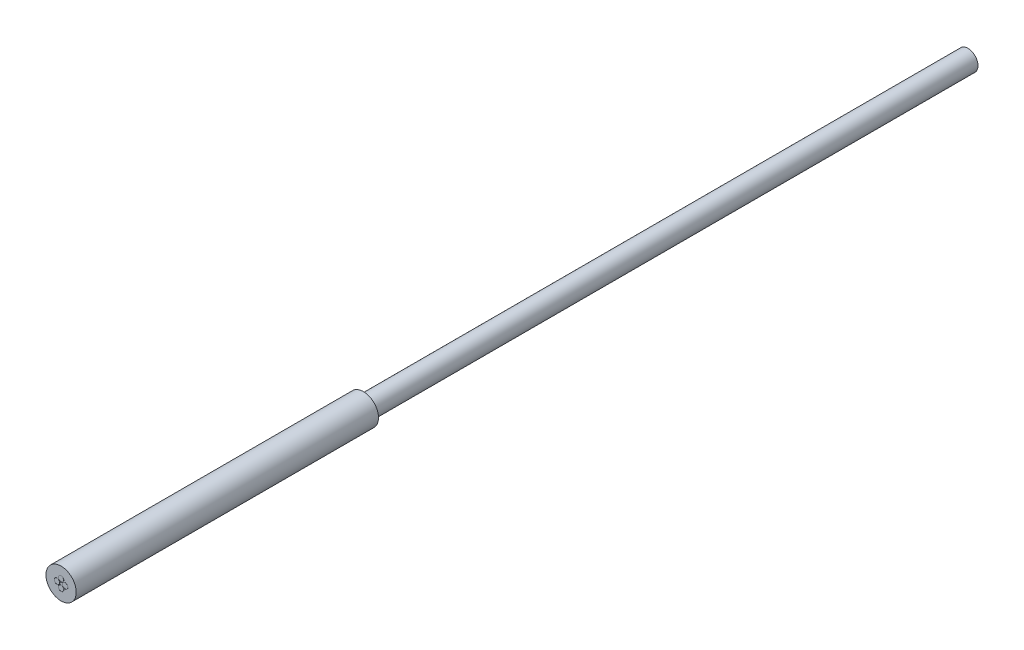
ISO-10303-21;
HEADER;
FILE_DESCRIPTION(('STEP AP214'),'2;1');
FILE_NAME('part.step','',(''),(''),'','','');
FILE_SCHEMA(('AUTOMOTIVE_DESIGN { 1 0 10303 214 1 1 1 1 }'));
ENDSEC;
DATA;
#1=APPLICATION_CONTEXT('core data for automotive mechanical design processes');
#2=APPLICATION_PROTOCOL_DEFINITION('international standard','automotive_design',2000,#1);
#3=PRODUCT_CONTEXT('',#1,'mechanical');
#4=PRODUCT('Part','Part','',(#3));
#5=PRODUCT_RELATED_PRODUCT_CATEGORY('part','',(#4));
#6=PRODUCT_DEFINITION_FORMATION('','',#4);
#7=PRODUCT_DEFINITION_CONTEXT('part definition',#1,'design');
#8=PRODUCT_DEFINITION('design','',#6,#7);
#9=PRODUCT_DEFINITION_SHAPE('','',#8);
#10=(LENGTH_UNIT() NAMED_UNIT(*) SI_UNIT(.MILLI.,.METRE.));
#11=(NAMED_UNIT(*) PLANE_ANGLE_UNIT() SI_UNIT($,.RADIAN.));
#12=(NAMED_UNIT(*) SI_UNIT($,.STERADIAN.) SOLID_ANGLE_UNIT());
#13=UNCERTAINTY_MEASURE_WITH_UNIT(LENGTH_MEASURE(1.E-05),#10,'distance_accuracy_value','');
#14=(GEOMETRIC_REPRESENTATION_CONTEXT(3) GLOBAL_UNCERTAINTY_ASSIGNED_CONTEXT((#13)) GLOBAL_UNIT_ASSIGNED_CONTEXT((#10,
#11,#12)) REPRESENTATION_CONTEXT('',''));
#15=CARTESIAN_POINT('',(0.,0.,0.));
#16=DIRECTION('',(0.,0.,1.));
#17=DIRECTION('',(1.,0.,0.));
#18=AXIS2_PLACEMENT_3D('',#15,#16,#17);
#19=CARTESIAN_POINT('',(0.,0.,-15.));
#20=DIRECTION('',(0.,0.,1.));
#21=DIRECTION('',(1.,0.,0.));
#22=AXIS2_PLACEMENT_3D('',#19,#20,#21);
#23=CYLINDRICAL_SURFACE('',#22,0.750000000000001);
#24=CARTESIAN_POINT('',(0.,0.,-15.));
#25=DIRECTION('',(0.,0.,1.));
#26=DIRECTION('',(1.,0.,0.));
#27=AXIS2_PLACEMENT_3D('',#24,#25,#26);
#28=CIRCLE('',#27,0.750000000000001);
#29=CARTESIAN_POINT('',(0.750000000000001,0.,-15.));
#30=VERTEX_POINT('',#29);
#31=EDGE_CURVE('E40',#30,#30,#28,.T.);
#32=ORIENTED_EDGE('',*,*,#31,.T.);
#33=EDGE_LOOP('',(#32));
#34=FACE_BOUND('',#33,.T.);
#35=CARTESIAN_POINT('',(0.,0.,0.));
#36=DIRECTION('',(0.,0.,1.));
#37=DIRECTION('',(1.,0.,0.));
#38=AXIS2_PLACEMENT_3D('',#35,#36,#37);
#39=CIRCLE('',#38,0.750000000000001);
#40=CARTESIAN_POINT('',(0.750000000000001,0.,0.));
#41=VERTEX_POINT('',#40);
#42=EDGE_CURVE('E36',#41,#41,#39,.T.);
#43=ORIENTED_EDGE('',*,*,#42,.F.);
#44=EDGE_LOOP('',(#43));
#45=FACE_BOUND('',#44,.T.);
#46=ADVANCED_FACE('F33',(#34,#45),#23,.T.);
#47=CARTESIAN_POINT('',(0.,0.,-15.));
#48=DIRECTION('',(0.,0.,1.));
#49=DIRECTION('',(1.,0.,0.));
#50=AXIS2_PLACEMENT_3D('',#47,#48,#49);
#51=PLANE('',#50);
#52=CARTESIAN_POINT('',(0.,0.,-15.));
#53=DIRECTION('',(0.,0.,-1.));
#54=DIRECTION('',(-1.,0.,0.));
#55=AXIS2_PLACEMENT_3D('',#52,#53,#54);
#56=CIRCLE('',#55,0.5);
#57=CARTESIAN_POINT('',(-0.5,0.,-15.));
#58=VERTEX_POINT('',#57);
#59=EDGE_CURVE('E10',#58,#58,#56,.T.);
#60=ORIENTED_EDGE('',*,*,#59,.F.);
#61=EDGE_LOOP('',(#60));
#62=FACE_BOUND('',#61,.T.);
#63=ORIENTED_EDGE('',*,*,#31,.F.);
#64=EDGE_LOOP('',(#63));
#65=FACE_BOUND('',#64,.T.);
#66=ADVANCED_FACE('F118',(#62,#65),#51,.F.);
#67=CARTESIAN_POINT('',(0.,0.,0.));
#68=DIRECTION('',(0.,0.,1.));
#69=DIRECTION('',(1.,0.,0.));
#70=AXIS2_PLACEMENT_3D('',#67,#68,#69);
#71=PLANE('',#70);
#72=CARTESIAN_POINT('',(0.,-0.201525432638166,0.));
#73=DIRECTION('',(0.,0.,1.));
#74=DIRECTION('',(1.,0.,0.));
#75=AXIS2_PLACEMENT_3D('',#72,#73,#74);
#76=CIRCLE('',#75,0.1375);
#77=CARTESIAN_POINT('',(0.1375,-0.201525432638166,0.));
#78=VERTEX_POINT('',#77);
#79=EDGE_CURVE('E74',#78,#78,#76,.T.);
#80=ORIENTED_EDGE('',*,*,#79,.F.);
#81=EDGE_LOOP('',(#80));
#82=FACE_BOUND('',#81,.T.);
#83=CARTESIAN_POINT('',(0.201525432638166,0.,0.));
#84=DIRECTION('',(0.,0.,1.));
#85=DIRECTION('',(1.,0.,0.));
#86=AXIS2_PLACEMENT_3D('',#83,#84,#85);
#87=CIRCLE('',#86,0.1375);
#88=CARTESIAN_POINT('',(0.339025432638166,0.,0.));
#89=VERTEX_POINT('',#88);
#90=EDGE_CURVE('E62',#89,#89,#87,.T.);
#91=ORIENTED_EDGE('',*,*,#90,.F.);
#92=EDGE_LOOP('',(#91));
#93=FACE_BOUND('',#92,.T.);
#94=CARTESIAN_POINT('',(-0.201525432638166,0.,0.));
#95=DIRECTION('',(0.,0.,1.));
#96=DIRECTION('',(1.,0.,0.));
#97=AXIS2_PLACEMENT_3D('',#94,#95,#96);
#98=CIRCLE('',#97,0.1375);
#99=CARTESIAN_POINT('',(-0.064025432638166,0.,0.));
#100=VERTEX_POINT('',#99);
#101=EDGE_CURVE('E86',#100,#100,#98,.T.);
#102=ORIENTED_EDGE('',*,*,#101,.F.);
#103=EDGE_LOOP('',(#102));
#104=FACE_BOUND('',#103,.T.);
#105=CARTESIAN_POINT('',(0.,0.201525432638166,0.));
#106=DIRECTION('',(0.,0.,1.));
#107=DIRECTION('',(1.,0.,0.));
#108=AXIS2_PLACEMENT_3D('',#105,#106,#107);
#109=CIRCLE('',#108,0.1375);
#110=CARTESIAN_POINT('',(0.1375,0.201525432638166,0.));
#111=VERTEX_POINT('',#110);
#112=EDGE_CURVE('E50',#111,#111,#109,.T.);
#113=ORIENTED_EDGE('',*,*,#112,.F.);
#114=EDGE_LOOP('',(#113));
#115=FACE_BOUND('',#114,.T.);
#116=ORIENTED_EDGE('',*,*,#42,.T.);
#117=EDGE_LOOP('',(#116));
#118=FACE_BOUND('',#117,.T.);
#119=ADVANCED_FACE('F114',(#82,#93,#104,#115,#118),#71,.T.);
#120=CARTESIAN_POINT('',(0.,0.,-45.));
#121=DIRECTION('',(0.,0.,1.));
#122=DIRECTION('',(1.,0.,0.));
#123=AXIS2_PLACEMENT_3D('',#120,#121,#122);
#124=CYLINDRICAL_SURFACE('',#123,0.5);
#125=CARTESIAN_POINT('',(0.,0.,-45.));
#126=DIRECTION('',(0.,0.,-1.));
#127=DIRECTION('',(-1.,0.,0.));
#128=AXIS2_PLACEMENT_3D('',#125,#126,#127);
#129=CIRCLE('',#128,0.5);
#130=CARTESIAN_POINT('',(-0.5,0.,-45.));
#131=VERTEX_POINT('',#130);
#132=EDGE_CURVE('E46',#131,#131,#129,.T.);
#133=ORIENTED_EDGE('',*,*,#132,.F.);
#134=EDGE_LOOP('',(#133));
#135=FACE_BOUND('',#134,.T.);
#136=ORIENTED_EDGE('',*,*,#59,.T.);
#137=EDGE_LOOP('',(#136));
#138=FACE_BOUND('',#137,.T.);
#139=ADVANCED_FACE('F117',(#135,#138),#124,.T.);
#140=CARTESIAN_POINT('',(0.,0.,-45.));
#141=DIRECTION('',(0.,0.,-1.));
#142=DIRECTION('',(-1.,0.,0.));
#143=AXIS2_PLACEMENT_3D('',#140,#141,#142);
#144=PLANE('',#143);
#145=ORIENTED_EDGE('',*,*,#132,.T.);
#146=EDGE_LOOP('',(#145));
#147=FACE_BOUND('',#146,.T.);
#148=ADVANCED_FACE('F141',(#147),#144,.T.);
#149=CARTESIAN_POINT('',(0.,0.201525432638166,-0.1));
#150=DIRECTION('',(0.,0.,1.));
#151=DIRECTION('',(1.,0.,0.));
#152=AXIS2_PLACEMENT_3D('',#149,#150,#151);
#153=CYLINDRICAL_SURFACE('',#152,0.1375);
#154=CARTESIAN_POINT('',(0.,0.201525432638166,-0.1));
#155=DIRECTION('',(0.,0.,1.));
#156=DIRECTION('',(1.,0.,0.));
#157=AXIS2_PLACEMENT_3D('',#154,#155,#156);
#158=CIRCLE('',#157,0.1375);
#159=CARTESIAN_POINT('',(0.1375,0.201525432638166,-0.1));
#160=VERTEX_POINT('',#159);
#161=EDGE_CURVE('E49',#160,#160,#158,.T.);
#162=ORIENTED_EDGE('',*,*,#161,.F.);
#163=EDGE_LOOP('',(#162));
#164=FACE_BOUND('',#163,.T.);
#165=ORIENTED_EDGE('',*,*,#112,.T.);
#166=EDGE_LOOP('',(#165));
#167=FACE_BOUND('',#166,.T.);
#168=ADVANCED_FACE('F145',(#164,#167),#153,.F.);
#169=CARTESIAN_POINT('',(0.,0.201525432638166,-0.1));
#170=DIRECTION('',(0.,0.,1.));
#171=DIRECTION('',(1.,0.,0.));
#172=AXIS2_PLACEMENT_3D('',#169,#170,#171);
#173=PLANE('',#172);
#174=CARTESIAN_POINT('',(0.,0.201525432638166,-0.1));
#175=DIRECTION('',(0.,0.,1.));
#176=DIRECTION('',(1.,0.,0.));
#177=AXIS2_PLACEMENT_3D('',#174,#175,#176);
#178=CIRCLE('',#177,0.1325);
#179=CARTESIAN_POINT('',(0.1325,0.201525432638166,-0.1));
#180=VERTEX_POINT('',#179);
#181=EDGE_CURVE('E53',#180,#180,#178,.T.);
#182=ORIENTED_EDGE('',*,*,#181,.F.);
#183=EDGE_LOOP('',(#182));
#184=FACE_BOUND('',#183,.T.);
#185=ORIENTED_EDGE('',*,*,#161,.T.);
#186=EDGE_LOOP('',(#185));
#187=FACE_BOUND('',#186,.T.);
#188=ADVANCED_FACE('F149',(#184,#187),#173,.T.);
#189=CARTESIAN_POINT('',(0.,0.201525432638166,-0.1));
#190=DIRECTION('',(0.,0.,1.));
#191=DIRECTION('',(1.,0.,0.));
#192=AXIS2_PLACEMENT_3D('',#189,#190,#191);
#193=CYLINDRICAL_SURFACE('',#192,0.1325);
#194=ORIENTED_EDGE('',*,*,#181,.T.);
#195=EDGE_LOOP('',(#194));
#196=FACE_BOUND('',#195,.T.);
#197=CARTESIAN_POINT('',(0.,0.201525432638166,0.));
#198=DIRECTION('',(0.,0.,1.));
#199=DIRECTION('',(1.,0.,0.));
#200=AXIS2_PLACEMENT_3D('',#197,#198,#199);
#201=CIRCLE('',#200,0.1325);
#202=CARTESIAN_POINT('',(0.1325,0.201525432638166,0.));
#203=VERTEX_POINT('',#202);
#204=EDGE_CURVE('E56',#203,#203,#201,.T.);
#205=ORIENTED_EDGE('',*,*,#204,.F.);
#206=EDGE_LOOP('',(#205));
#207=FACE_BOUND('',#206,.T.);
#208=ADVANCED_FACE('F110',(#196,#207),#193,.T.);
#209=CARTESIAN_POINT('',(-0.201525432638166,0.,-0.1));
#210=DIRECTION('',(0.,0.,1.));
#211=DIRECTION('',(1.,0.,0.));
#212=AXIS2_PLACEMENT_3D('',#209,#210,#211);
#213=CYLINDRICAL_SURFACE('',#212,0.1375);
#214=CARTESIAN_POINT('',(-0.201525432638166,0.,-0.1));
#215=DIRECTION('',(0.,0.,1.));
#216=DIRECTION('',(1.,0.,0.));
#217=AXIS2_PLACEMENT_3D('',#214,#215,#216);
#218=CIRCLE('',#217,0.1375);
#219=CARTESIAN_POINT('',(-0.064025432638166,0.,-0.1));
#220=VERTEX_POINT('',#219);
#221=EDGE_CURVE('E83',#220,#220,#218,.T.);
#222=ORIENTED_EDGE('',*,*,#221,.F.);
#223=EDGE_LOOP('',(#222));
#224=FACE_BOUND('',#223,.T.);
#225=ORIENTED_EDGE('',*,*,#101,.T.);
#226=EDGE_LOOP('',(#225));
#227=FACE_BOUND('',#226,.T.);
#228=ADVANCED_FACE('F104',(#224,#227),#213,.F.);
#229=CARTESIAN_POINT('',(-0.201525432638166,0.,-0.1));
#230=DIRECTION('',(0.,0.,1.));
#231=DIRECTION('',(1.,0.,0.));
#232=AXIS2_PLACEMENT_3D('',#229,#230,#231);
#233=PLANE('',#232);
#234=CARTESIAN_POINT('',(-0.201525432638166,0.,-0.1));
#235=DIRECTION('',(0.,0.,1.));
#236=DIRECTION('',(1.,0.,0.));
#237=AXIS2_PLACEMENT_3D('',#234,#235,#236);
#238=CIRCLE('',#237,0.1325);
#239=CARTESIAN_POINT('',(-0.069025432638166,0.,-0.1));
#240=VERTEX_POINT('',#239);
#241=EDGE_CURVE('E89',#240,#240,#238,.T.);
#242=ORIENTED_EDGE('',*,*,#241,.F.);
#243=EDGE_LOOP('',(#242));
#244=FACE_BOUND('',#243,.T.);
#245=ORIENTED_EDGE('',*,*,#221,.T.);
#246=EDGE_LOOP('',(#245));
#247=FACE_BOUND('',#246,.T.);
#248=ADVANCED_FACE('F101',(#244,#247),#233,.T.);
#249=CARTESIAN_POINT('',(-0.201525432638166,0.,-0.1));
#250=DIRECTION('',(0.,0.,1.));
#251=DIRECTION('',(1.,0.,0.));
#252=AXIS2_PLACEMENT_3D('',#249,#250,#251);
#253=CYLINDRICAL_SURFACE('',#252,0.1325);
#254=ORIENTED_EDGE('',*,*,#241,.T.);
#255=EDGE_LOOP('',(#254));
#256=FACE_BOUND('',#255,.T.);
#257=CARTESIAN_POINT('',(-0.201525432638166,0.,0.));
#258=DIRECTION('',(0.,0.,1.));
#259=DIRECTION('',(1.,0.,0.));
#260=AXIS2_PLACEMENT_3D('',#257,#258,#259);
#261=CIRCLE('',#260,0.1325);
#262=CARTESIAN_POINT('',(-0.069025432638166,0.,0.));
#263=VERTEX_POINT('',#262);
#264=EDGE_CURVE('E92',#263,#263,#261,.T.);
#265=ORIENTED_EDGE('',*,*,#264,.F.);
#266=EDGE_LOOP('',(#265));
#267=FACE_BOUND('',#266,.T.);
#268=ADVANCED_FACE('F98',(#256,#267),#253,.T.);
#269=CARTESIAN_POINT('',(0.201525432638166,0.,-0.1));
#270=DIRECTION('',(0.,0.,1.));
#271=DIRECTION('',(1.,0.,0.));
#272=AXIS2_PLACEMENT_3D('',#269,#270,#271);
#273=CYLINDRICAL_SURFACE('',#272,0.1375);
#274=CARTESIAN_POINT('',(0.201525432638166,0.,-0.1));
#275=DIRECTION('',(0.,0.,1.));
#276=DIRECTION('',(1.,0.,0.));
#277=AXIS2_PLACEMENT_3D('',#274,#275,#276);
#278=CIRCLE('',#277,0.1375);
#279=CARTESIAN_POINT('',(0.339025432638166,0.,-0.1));
#280=VERTEX_POINT('',#279);
#281=EDGE_CURVE('E59',#280,#280,#278,.T.);
#282=ORIENTED_EDGE('',*,*,#281,.F.);
#283=EDGE_LOOP('',(#282));
#284=FACE_BOUND('',#283,.T.);
#285=ORIENTED_EDGE('',*,*,#90,.T.);
#286=EDGE_LOOP('',(#285));
#287=FACE_BOUND('',#286,.T.);
#288=ADVANCED_FACE('F157',(#284,#287),#273,.F.);
#289=CARTESIAN_POINT('',(0.201525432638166,0.,-0.1));
#290=DIRECTION('',(0.,0.,1.));
#291=DIRECTION('',(1.,0.,0.));
#292=AXIS2_PLACEMENT_3D('',#289,#290,#291);
#293=PLANE('',#292);
#294=CARTESIAN_POINT('',(0.201525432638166,0.,-0.1));
#295=DIRECTION('',(0.,0.,1.));
#296=DIRECTION('',(1.,0.,0.));
#297=AXIS2_PLACEMENT_3D('',#294,#295,#296);
#298=CIRCLE('',#297,0.1325);
#299=CARTESIAN_POINT('',(0.334025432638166,0.,-0.1));
#300=VERTEX_POINT('',#299);
#301=EDGE_CURVE('E65',#300,#300,#298,.T.);
#302=ORIENTED_EDGE('',*,*,#301,.F.);
#303=EDGE_LOOP('',(#302));
#304=FACE_BOUND('',#303,.T.);
#305=ORIENTED_EDGE('',*,*,#281,.T.);
#306=EDGE_LOOP('',(#305));
#307=FACE_BOUND('',#306,.T.);
#308=ADVANCED_FACE('F160',(#304,#307),#293,.T.);
#309=CARTESIAN_POINT('',(0.201525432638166,0.,-0.1));
#310=DIRECTION('',(0.,0.,1.));
#311=DIRECTION('',(1.,0.,0.));
#312=AXIS2_PLACEMENT_3D('',#309,#310,#311);
#313=CYLINDRICAL_SURFACE('',#312,0.1325);
#314=ORIENTED_EDGE('',*,*,#301,.T.);
#315=EDGE_LOOP('',(#314));
#316=FACE_BOUND('',#315,.T.);
#317=CARTESIAN_POINT('',(0.201525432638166,0.,0.));
#318=DIRECTION('',(0.,0.,1.));
#319=DIRECTION('',(1.,0.,0.));
#320=AXIS2_PLACEMENT_3D('',#317,#318,#319);
#321=CIRCLE('',#320,0.1325);
#322=CARTESIAN_POINT('',(0.334025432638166,0.,0.));
#323=VERTEX_POINT('',#322);
#324=EDGE_CURVE('E68',#323,#323,#321,.T.);
#325=ORIENTED_EDGE('',*,*,#324,.F.);
#326=EDGE_LOOP('',(#325));
#327=FACE_BOUND('',#326,.T.);
#328=ADVANCED_FACE('F164',(#316,#327),#313,.T.);
#329=CARTESIAN_POINT('',(0.,-0.201525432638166,-0.1));
#330=DIRECTION('',(0.,0.,1.));
#331=DIRECTION('',(1.,0.,0.));
#332=AXIS2_PLACEMENT_3D('',#329,#330,#331);
#333=CYLINDRICAL_SURFACE('',#332,0.1375);
#334=CARTESIAN_POINT('',(0.,-0.201525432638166,-0.1));
#335=DIRECTION('',(0.,0.,1.));
#336=DIRECTION('',(1.,0.,0.));
#337=AXIS2_PLACEMENT_3D('',#334,#335,#336);
#338=CIRCLE('',#337,0.1375);
#339=CARTESIAN_POINT('',(0.1375,-0.201525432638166,-0.1));
#340=VERTEX_POINT('',#339);
#341=EDGE_CURVE('E71',#340,#340,#338,.T.);
#342=ORIENTED_EDGE('',*,*,#341,.F.);
#343=EDGE_LOOP('',(#342));
#344=FACE_BOUND('',#343,.T.);
#345=ORIENTED_EDGE('',*,*,#79,.T.);
#346=EDGE_LOOP('',(#345));
#347=FACE_BOUND('',#346,.T.);
#348=ADVANCED_FACE('F168',(#344,#347),#333,.F.);
#349=CARTESIAN_POINT('',(0.,-0.201525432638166,-0.1));
#350=DIRECTION('',(0.,0.,1.));
#351=DIRECTION('',(1.,0.,0.));
#352=AXIS2_PLACEMENT_3D('',#349,#350,#351);
#353=PLANE('',#352);
#354=CARTESIAN_POINT('',(0.,-0.201525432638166,-0.1));
#355=DIRECTION('',(0.,0.,1.));
#356=DIRECTION('',(1.,0.,0.));
#357=AXIS2_PLACEMENT_3D('',#354,#355,#356);
#358=CIRCLE('',#357,0.1325);
#359=CARTESIAN_POINT('',(0.1325,-0.201525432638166,-0.1));
#360=VERTEX_POINT('',#359);
#361=EDGE_CURVE('E77',#360,#360,#358,.T.);
#362=ORIENTED_EDGE('',*,*,#361,.F.);
#363=EDGE_LOOP('',(#362));
#364=FACE_BOUND('',#363,.T.);
#365=ORIENTED_EDGE('',*,*,#341,.T.);
#366=EDGE_LOOP('',(#365));
#367=FACE_BOUND('',#366,.T.);
#368=ADVANCED_FACE('F172',(#364,#367),#353,.T.);
#369=CARTESIAN_POINT('',(0.,-0.201525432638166,-0.1));
#370=DIRECTION('',(0.,0.,1.));
#371=DIRECTION('',(1.,0.,0.));
#372=AXIS2_PLACEMENT_3D('',#369,#370,#371);
#373=CYLINDRICAL_SURFACE('',#372,0.1325);
#374=ORIENTED_EDGE('',*,*,#361,.T.);
#375=EDGE_LOOP('',(#374));
#376=FACE_BOUND('',#375,.T.);
#377=CARTESIAN_POINT('',(0.,-0.201525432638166,0.));
#378=DIRECTION('',(0.,0.,1.));
#379=DIRECTION('',(1.,0.,0.));
#380=AXIS2_PLACEMENT_3D('',#377,#378,#379);
#381=CIRCLE('',#380,0.1325);
#382=CARTESIAN_POINT('',(0.1325,-0.201525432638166,0.));
#383=VERTEX_POINT('',#382);
#384=EDGE_CURVE('E80',#383,#383,#381,.T.);
#385=ORIENTED_EDGE('',*,*,#384,.F.);
#386=EDGE_LOOP('',(#385));
#387=FACE_BOUND('',#386,.T.);
#388=ADVANCED_FACE('F176',(#376,#387),#373,.T.);
#389=ORIENTED_EDGE('',*,*,#204,.T.);
#390=EDGE_LOOP('',(#389));
#391=FACE_BOUND('',#390,.T.);
#392=ADVANCED_FACE('F121',(#391),#71,.T.);
#393=ORIENTED_EDGE('',*,*,#264,.T.);
#394=EDGE_LOOP('',(#393));
#395=FACE_BOUND('',#394,.T.);
#396=ADVANCED_FACE('F216',(#395),#71,.T.);
#397=ORIENTED_EDGE('',*,*,#324,.T.);
#398=EDGE_LOOP('',(#397));
#399=FACE_BOUND('',#398,.T.);
#400=ADVANCED_FACE('F223',(#399),#71,.T.);
#401=ORIENTED_EDGE('',*,*,#384,.T.);
#402=EDGE_LOOP('',(#401));
#403=FACE_BOUND('',#402,.T.);
#404=ADVANCED_FACE('F120',(#403),#71,.T.);
#405=CLOSED_SHELL('',(#46,#66,#119,#139,#148,#168,#188,#208,#228,#248,#268,#288,#308,#328,#348,
#368,#388,#392,#396,#400,#404));
#406=MANIFOLD_SOLID_BREP('B2',#405);
#407=ADVANCED_BREP_SHAPE_REPRESENTATION('',(#18,#406),#14);
#408=SHAPE_DEFINITION_REPRESENTATION(#9,#407);
ENDSEC;
END-ISO-10303-21;
